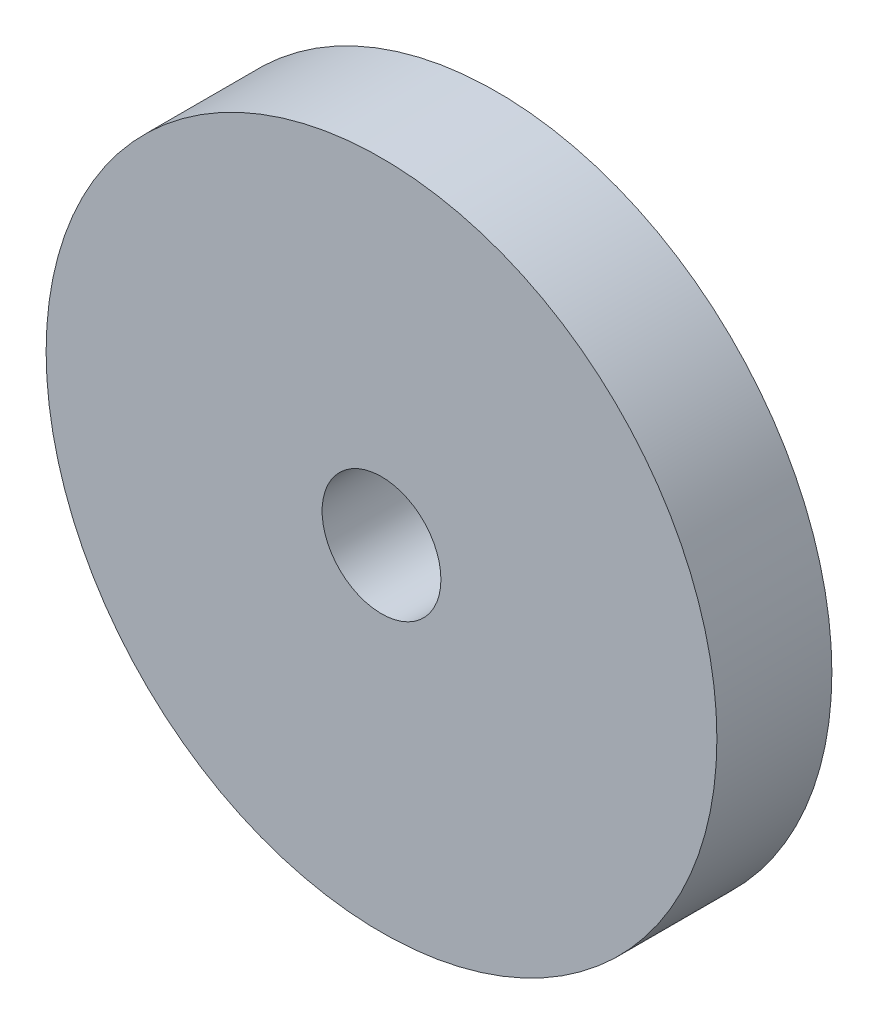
from build123d import *

# Parameters (mm, degrees)
ESQUISSE1_R      = 17.5
ESQUISSE1_R_2    = 3.1
EXTRUSION1_DEPTH = 6


with BuildPart() as part:
    # Esquisse1 → Extrusion1 (new body)
    with BuildSketch(Plane.XY):
        Circle(ESQUISSE1_R)
        Circle(ESQUISSE1_R_2, mode=Mode.SUBTRACT)
    extrude(amount=EXTRUSION1_DEPTH)


solid = part.part
